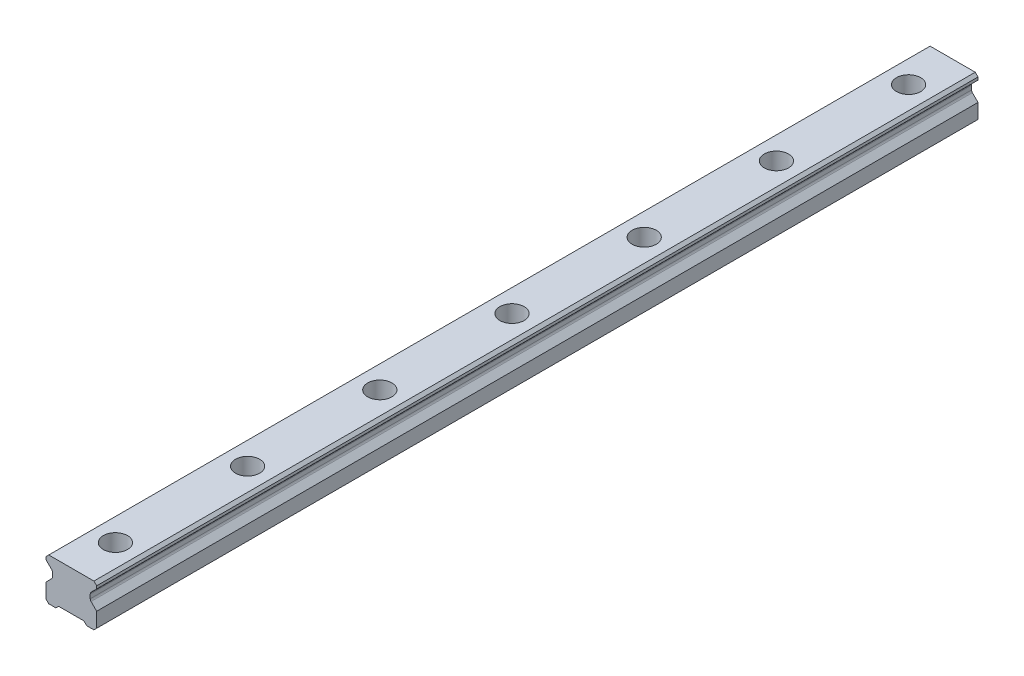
ISO-10303-21;
HEADER;
FILE_DESCRIPTION(('STEP AP214'),'2;1');
FILE_NAME('part.step','',(''),(''),'','','');
FILE_SCHEMA(('AUTOMOTIVE_DESIGN { 1 0 10303 214 1 1 1 1 }'));
ENDSEC;
DATA;
#1=APPLICATION_CONTEXT('core data for automotive mechanical design processes');
#2=APPLICATION_PROTOCOL_DEFINITION('international standard','automotive_design',2000,#1);
#3=PRODUCT_CONTEXT('',#1,'mechanical');
#4=PRODUCT('Part','Part','',(#3));
#5=PRODUCT_RELATED_PRODUCT_CATEGORY('part','',(#4));
#6=PRODUCT_DEFINITION_FORMATION('','',#4);
#7=PRODUCT_DEFINITION_CONTEXT('part definition',#1,'design');
#8=PRODUCT_DEFINITION('design','',#6,#7);
#9=PRODUCT_DEFINITION_SHAPE('','',#8);
#10=(LENGTH_UNIT() NAMED_UNIT(*) SI_UNIT(.MILLI.,.METRE.));
#11=(NAMED_UNIT(*) PLANE_ANGLE_UNIT() SI_UNIT($,.RADIAN.));
#12=(NAMED_UNIT(*) SI_UNIT($,.STERADIAN.) SOLID_ANGLE_UNIT());
#13=UNCERTAINTY_MEASURE_WITH_UNIT(LENGTH_MEASURE(1.E-05),#10,'distance_accuracy_value','');
#14=(GEOMETRIC_REPRESENTATION_CONTEXT(3) GLOBAL_UNCERTAINTY_ASSIGNED_CONTEXT((#13)) GLOBAL_UNIT_ASSIGNED_CONTEXT((#10,
#11,#12)) REPRESENTATION_CONTEXT('',''));
#15=CARTESIAN_POINT('',(0.,0.,0.));
#16=DIRECTION('',(0.,0.,1.));
#17=DIRECTION('',(1.,0.,0.));
#18=AXIS2_PLACEMENT_3D('',#15,#16,#17);
#19=CARTESIAN_POINT('',(0.,10.2,-180.));
#20=DIRECTION('',(0.,1.,0.));
#21=DIRECTION('',(0.,0.,1.));
#22=AXIS2_PLACEMENT_3D('',#19,#20,#21);
#23=PLANE('',#22);
#24=CARTESIAN_POINT('',(0.,10.2,-180.));
#25=DIRECTION('',(0.,1.,0.));
#26=DIRECTION('',(0.,0.,1.));
#27=AXIS2_PLACEMENT_3D('',#24,#25,#26);
#28=CIRCLE('',#27,3.5);
#29=CARTESIAN_POINT('',(0.,10.2,-176.5));
#30=VERTEX_POINT('',#29);
#31=EDGE_CURVE('E398',#30,#30,#28,.T.);
#32=ORIENTED_EDGE('',*,*,#31,.F.);
#33=EDGE_LOOP('',(#32));
#34=FACE_BOUND('',#33,.T.);
#35=CARTESIAN_POINT('',(0.,10.2,-180.));
#36=DIRECTION('',(0.,1.,0.));
#37=DIRECTION('',(0.,0.,1.));
#38=AXIS2_PLACEMENT_3D('',#35,#36,#37);
#39=CIRCLE('',#38,5.5);
#40=CARTESIAN_POINT('',(0.,10.2,-174.5));
#41=VERTEX_POINT('',#40);
#42=EDGE_CURVE('E11',#41,#41,#39,.T.);
#43=ORIENTED_EDGE('',*,*,#42,.T.);
#44=EDGE_LOOP('',(#43));
#45=FACE_BOUND('',#44,.T.);
#46=ADVANCED_FACE('F39',(#34,#45),#23,.T.);
#47=CARTESIAN_POINT('',(0.,10.2,-180.));
#48=DIRECTION('',(0.,1.,0.));
#49=DIRECTION('',(0.,0.,1.));
#50=AXIS2_PLACEMENT_3D('',#47,#48,#49);
#51=CYLINDRICAL_SURFACE('',#50,5.5);
#52=ORIENTED_EDGE('',*,*,#42,.F.);
#53=EDGE_LOOP('',(#52));
#54=FACE_BOUND('',#53,.T.);
#55=CARTESIAN_POINT('',(0.,19.2,-180.));
#56=DIRECTION('',(0.,1.,0.));
#57=DIRECTION('',(0.,0.,1.));
#58=AXIS2_PLACEMENT_3D('',#55,#56,#57);
#59=CIRCLE('',#58,5.5);
#60=CARTESIAN_POINT('',(0.,19.2,-174.5));
#61=VERTEX_POINT('',#60);
#62=EDGE_CURVE('E48',#61,#61,#59,.T.);
#63=ORIENTED_EDGE('',*,*,#62,.T.);
#64=EDGE_LOOP('',(#63));
#65=FACE_BOUND('',#64,.T.);
#66=ADVANCED_FACE('F635',(#54,#65),#51,.F.);
#67=CARTESIAN_POINT('',(0.,10.2,-120.));
#68=DIRECTION('',(0.,1.,0.));
#69=DIRECTION('',(0.,0.,1.));
#70=AXIS2_PLACEMENT_3D('',#67,#68,#69);
#71=PLANE('',#70);
#72=CARTESIAN_POINT('',(0.,10.2,-120.));
#73=DIRECTION('',(0.,1.,0.));
#74=DIRECTION('',(0.,0.,1.));
#75=AXIS2_PLACEMENT_3D('',#72,#73,#74);
#76=CIRCLE('',#75,3.5);
#77=CARTESIAN_POINT('',(0.,10.2,-116.5));
#78=VERTEX_POINT('',#77);
#79=EDGE_CURVE('E403',#78,#78,#76,.T.);
#80=ORIENTED_EDGE('',*,*,#79,.F.);
#81=EDGE_LOOP('',(#80));
#82=FACE_BOUND('',#81,.T.);
#83=CARTESIAN_POINT('',(0.,10.2,-120.));
#84=DIRECTION('',(0.,1.,0.));
#85=DIRECTION('',(0.,0.,1.));
#86=AXIS2_PLACEMENT_3D('',#83,#84,#85);
#87=CIRCLE('',#86,5.5);
#88=CARTESIAN_POINT('',(0.,10.2,-114.5));
#89=VERTEX_POINT('',#88);
#90=EDGE_CURVE('E382',#89,#89,#87,.T.);
#91=ORIENTED_EDGE('',*,*,#90,.T.);
#92=EDGE_LOOP('',(#91));
#93=FACE_BOUND('',#92,.T.);
#94=ADVANCED_FACE('F640',(#82,#93),#71,.T.);
#95=CARTESIAN_POINT('',(0.,10.2,-120.));
#96=DIRECTION('',(0.,1.,0.));
#97=DIRECTION('',(0.,0.,1.));
#98=AXIS2_PLACEMENT_3D('',#95,#96,#97);
#99=CYLINDRICAL_SURFACE('',#98,5.5);
#100=ORIENTED_EDGE('',*,*,#90,.F.);
#101=EDGE_LOOP('',(#100));
#102=FACE_BOUND('',#101,.T.);
#103=CARTESIAN_POINT('',(0.,19.2,-120.));
#104=DIRECTION('',(0.,1.,0.));
#105=DIRECTION('',(0.,0.,1.));
#106=AXIS2_PLACEMENT_3D('',#103,#104,#105);
#107=CIRCLE('',#106,5.5);
#108=CARTESIAN_POINT('',(0.,19.2,-114.5));
#109=VERTEX_POINT('',#108);
#110=EDGE_CURVE('E378',#109,#109,#107,.T.);
#111=ORIENTED_EDGE('',*,*,#110,.T.);
#112=EDGE_LOOP('',(#111));
#113=FACE_BOUND('',#112,.T.);
#114=ADVANCED_FACE('F715',(#102,#113),#99,.F.);
#115=CARTESIAN_POINT('',(0.,10.2,-60.));
#116=DIRECTION('',(0.,1.,0.));
#117=DIRECTION('',(0.,0.,1.));
#118=AXIS2_PLACEMENT_3D('',#115,#116,#117);
#119=PLANE('',#118);
#120=CARTESIAN_POINT('',(0.,10.2,-60.));
#121=DIRECTION('',(0.,1.,0.));
#122=DIRECTION('',(0.,0.,1.));
#123=AXIS2_PLACEMENT_3D('',#120,#121,#122);
#124=CIRCLE('',#123,3.5);
#125=CARTESIAN_POINT('',(0.,10.2,-56.5));
#126=VERTEX_POINT('',#125);
#127=EDGE_CURVE('E407',#126,#126,#124,.T.);
#128=ORIENTED_EDGE('',*,*,#127,.F.);
#129=EDGE_LOOP('',(#128));
#130=FACE_BOUND('',#129,.T.);
#131=CARTESIAN_POINT('',(0.,10.2,-60.));
#132=DIRECTION('',(0.,1.,0.));
#133=DIRECTION('',(0.,0.,1.));
#134=AXIS2_PLACEMENT_3D('',#131,#132,#133);
#135=CIRCLE('',#134,5.5);
#136=CARTESIAN_POINT('',(0.,10.2,-54.5));
#137=VERTEX_POINT('',#136);
#138=EDGE_CURVE('E374',#137,#137,#135,.T.);
#139=ORIENTED_EDGE('',*,*,#138,.T.);
#140=EDGE_LOOP('',(#139));
#141=FACE_BOUND('',#140,.T.);
#142=ADVANCED_FACE('F711',(#130,#141),#119,.T.);
#143=CARTESIAN_POINT('',(0.,10.2,-60.));
#144=DIRECTION('',(0.,1.,0.));
#145=DIRECTION('',(0.,0.,1.));
#146=AXIS2_PLACEMENT_3D('',#143,#144,#145);
#147=CYLINDRICAL_SURFACE('',#146,5.5);
#148=ORIENTED_EDGE('',*,*,#138,.F.);
#149=EDGE_LOOP('',(#148));
#150=FACE_BOUND('',#149,.T.);
#151=CARTESIAN_POINT('',(0.,19.2,-60.));
#152=DIRECTION('',(0.,1.,0.));
#153=DIRECTION('',(0.,0.,1.));
#154=AXIS2_PLACEMENT_3D('',#151,#152,#153);
#155=CIRCLE('',#154,5.5);
#156=CARTESIAN_POINT('',(0.,19.2,-54.5));
#157=VERTEX_POINT('',#156);
#158=EDGE_CURVE('E370',#157,#157,#155,.T.);
#159=ORIENTED_EDGE('',*,*,#158,.T.);
#160=EDGE_LOOP('',(#159));
#161=FACE_BOUND('',#160,.T.);
#162=ADVANCED_FACE('F707',(#150,#161),#147,.F.);
#163=CARTESIAN_POINT('',(0.,10.2,0.));
#164=DIRECTION('',(0.,1.,0.));
#165=DIRECTION('',(0.,0.,1.));
#166=AXIS2_PLACEMENT_3D('',#163,#164,#165);
#167=PLANE('',#166);
#168=CARTESIAN_POINT('',(0.,10.2,0.));
#169=DIRECTION('',(0.,1.,0.));
#170=DIRECTION('',(0.,0.,1.));
#171=AXIS2_PLACEMENT_3D('',#168,#169,#170);
#172=CIRCLE('',#171,3.5);
#173=CARTESIAN_POINT('',(0.,10.2,3.50000000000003));
#174=VERTEX_POINT('',#173);
#175=EDGE_CURVE('E411',#174,#174,#172,.T.);
#176=ORIENTED_EDGE('',*,*,#175,.F.);
#177=EDGE_LOOP('',(#176));
#178=FACE_BOUND('',#177,.T.);
#179=CARTESIAN_POINT('',(0.,10.2,0.));
#180=DIRECTION('',(0.,1.,0.));
#181=DIRECTION('',(0.,0.,1.));
#182=AXIS2_PLACEMENT_3D('',#179,#180,#181);
#183=CIRCLE('',#182,5.5);
#184=CARTESIAN_POINT('',(0.,10.2,5.50000000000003));
#185=VERTEX_POINT('',#184);
#186=EDGE_CURVE('E366',#185,#185,#183,.T.);
#187=ORIENTED_EDGE('',*,*,#186,.T.);
#188=EDGE_LOOP('',(#187));
#189=FACE_BOUND('',#188,.T.);
#190=ADVANCED_FACE('F703',(#178,#189),#167,.T.);
#191=CARTESIAN_POINT('',(0.,10.2,0.));
#192=DIRECTION('',(0.,1.,0.));
#193=DIRECTION('',(0.,0.,1.));
#194=AXIS2_PLACEMENT_3D('',#191,#192,#193);
#195=CYLINDRICAL_SURFACE('',#194,5.5);
#196=ORIENTED_EDGE('',*,*,#186,.F.);
#197=EDGE_LOOP('',(#196));
#198=FACE_BOUND('',#197,.T.);
#199=CARTESIAN_POINT('',(0.,19.2,0.));
#200=DIRECTION('',(0.,1.,0.));
#201=DIRECTION('',(0.,0.,1.));
#202=AXIS2_PLACEMENT_3D('',#199,#200,#201);
#203=CIRCLE('',#202,5.5);
#204=CARTESIAN_POINT('',(0.,19.2,5.50000000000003));
#205=VERTEX_POINT('',#204);
#206=EDGE_CURVE('E362',#205,#205,#203,.T.);
#207=ORIENTED_EDGE('',*,*,#206,.T.);
#208=EDGE_LOOP('',(#207));
#209=FACE_BOUND('',#208,.T.);
#210=ADVANCED_FACE('F699',(#198,#209),#195,.F.);
#211=CARTESIAN_POINT('',(0.,10.2,60.));
#212=DIRECTION('',(0.,1.,0.));
#213=DIRECTION('',(0.,0.,1.));
#214=AXIS2_PLACEMENT_3D('',#211,#212,#213);
#215=PLANE('',#214);
#216=CARTESIAN_POINT('',(0.,10.2,60.));
#217=DIRECTION('',(0.,1.,0.));
#218=DIRECTION('',(0.,0.,1.));
#219=AXIS2_PLACEMENT_3D('',#216,#217,#218);
#220=CIRCLE('',#219,3.5);
#221=CARTESIAN_POINT('',(0.,10.2,63.5));
#222=VERTEX_POINT('',#221);
#223=EDGE_CURVE('E426',#222,#222,#220,.T.);
#224=ORIENTED_EDGE('',*,*,#223,.F.);
#225=EDGE_LOOP('',(#224));
#226=FACE_BOUND('',#225,.T.);
#227=CARTESIAN_POINT('',(0.,10.2,60.));
#228=DIRECTION('',(0.,1.,0.));
#229=DIRECTION('',(0.,0.,1.));
#230=AXIS2_PLACEMENT_3D('',#227,#228,#229);
#231=CIRCLE('',#230,5.5);
#232=CARTESIAN_POINT('',(0.,10.2,65.5));
#233=VERTEX_POINT('',#232);
#234=EDGE_CURVE('E358',#233,#233,#231,.T.);
#235=ORIENTED_EDGE('',*,*,#234,.T.);
#236=EDGE_LOOP('',(#235));
#237=FACE_BOUND('',#236,.T.);
#238=ADVANCED_FACE('F695',(#226,#237),#215,.T.);
#239=CARTESIAN_POINT('',(0.,10.2,60.));
#240=DIRECTION('',(0.,1.,0.));
#241=DIRECTION('',(0.,0.,1.));
#242=AXIS2_PLACEMENT_3D('',#239,#240,#241);
#243=CYLINDRICAL_SURFACE('',#242,5.5);
#244=ORIENTED_EDGE('',*,*,#234,.F.);
#245=EDGE_LOOP('',(#244));
#246=FACE_BOUND('',#245,.T.);
#247=CARTESIAN_POINT('',(0.,19.2,60.));
#248=DIRECTION('',(0.,1.,0.));
#249=DIRECTION('',(0.,0.,1.));
#250=AXIS2_PLACEMENT_3D('',#247,#248,#249);
#251=CIRCLE('',#250,5.5);
#252=CARTESIAN_POINT('',(0.,19.2,65.5));
#253=VERTEX_POINT('',#252);
#254=EDGE_CURVE('E354',#253,#253,#251,.T.);
#255=ORIENTED_EDGE('',*,*,#254,.T.);
#256=EDGE_LOOP('',(#255));
#257=FACE_BOUND('',#256,.T.);
#258=ADVANCED_FACE('F692',(#246,#257),#243,.F.);
#259=CARTESIAN_POINT('',(11.5,0.,200.));
#260=DIRECTION('',(0.,1.,0.));
#261=DIRECTION('',(-1.,0.,0.));
#262=AXIS2_PLACEMENT_3D('',#259,#260,#261);
#263=PLANE('',#262);
#264=DIRECTION('',(1.,0.,0.));
#265=VECTOR('',#264,1.);
#266=CARTESIAN_POINT('',(11.5,0.,-200.));
#267=LINE('',#266,#265);
#268=CARTESIAN_POINT('',(-10.25,0.,-200.));
#269=VERTEX_POINT('',#268);
#270=CARTESIAN_POINT('',(-7.,0.,-200.));
#271=VERTEX_POINT('',#270);
#272=EDGE_CURVE('E229',#269,#271,#267,.T.);
#273=ORIENTED_EDGE('',*,*,#272,.T.);
#274=DIRECTION('',(0.,0.,1.));
#275=VECTOR('',#274,1.);
#276=CARTESIAN_POINT('',(-7.,0.,-200.));
#277=LINE('',#276,#275);
#278=CARTESIAN_POINT('',(-7.,0.,200.));
#279=VERTEX_POINT('',#278);
#280=EDGE_CURVE('E466',#271,#279,#277,.T.);
#281=ORIENTED_EDGE('',*,*,#280,.T.);
#282=DIRECTION('',(1.,0.,0.));
#283=VECTOR('',#282,1.);
#284=CARTESIAN_POINT('',(11.5,0.,200.));
#285=LINE('',#284,#283);
#286=CARTESIAN_POINT('',(-10.25,0.,200.));
#287=VERTEX_POINT('',#286);
#288=EDGE_CURVE('E535',#287,#279,#285,.T.);
#289=ORIENTED_EDGE('',*,*,#288,.F.);
#290=DIRECTION('',(0.,0.,-1.));
#291=VECTOR('',#290,1.);
#292=CARTESIAN_POINT('',(-10.25,0.,200.));
#293=LINE('',#292,#291);
#294=EDGE_CURVE('E289',#287,#269,#293,.T.);
#295=ORIENTED_EDGE('',*,*,#294,.T.);
#296=EDGE_LOOP('',(#273,#281,#289,#295));
#297=FACE_BOUND('',#296,.T.);
#298=ADVANCED_FACE('F664',(#297),#263,.F.);
#299=CARTESIAN_POINT('',(-11.5,19.2,200.));
#300=DIRECTION('',(1.,0.,0.));
#301=DIRECTION('',(0.,1.,0.));
#302=AXIS2_PLACEMENT_3D('',#299,#300,#301);
#303=PLANE('',#302);
#304=DIRECTION('',(0.,-1.,0.));
#305=VECTOR('',#304,1.);
#306=CARTESIAN_POINT('',(-11.5,19.2,200.));
#307=LINE('',#306,#305);
#308=CARTESIAN_POINT('',(-11.5,17.95,200.));
#309=VERTEX_POINT('',#308);
#310=CARTESIAN_POINT('',(-11.5,16.7,200.));
#311=VERTEX_POINT('',#310);
#312=EDGE_CURVE('E531',#309,#311,#307,.T.);
#313=ORIENTED_EDGE('',*,*,#312,.F.);
#314=DIRECTION('',(0.,0.,-1.));
#315=VECTOR('',#314,1.);
#316=CARTESIAN_POINT('',(-11.5,17.95,200.));
#317=LINE('',#316,#315);
#318=CARTESIAN_POINT('',(-11.5,17.95,-200.));
#319=VERTEX_POINT('',#318);
#320=EDGE_CURVE('E251',#309,#319,#317,.T.);
#321=ORIENTED_EDGE('',*,*,#320,.T.);
#322=DIRECTION('',(0.,-1.,0.));
#323=VECTOR('',#322,1.);
#324=CARTESIAN_POINT('',(-11.5,19.2,-200.));
#325=LINE('',#324,#323);
#326=CARTESIAN_POINT('',(-11.5,16.7,-200.));
#327=VERTEX_POINT('',#326);
#328=EDGE_CURVE('E230',#319,#327,#325,.T.);
#329=ORIENTED_EDGE('',*,*,#328,.T.);
#330=DIRECTION('',(0.,0.,1.));
#331=VECTOR('',#330,1.);
#332=CARTESIAN_POINT('',(-11.5,16.7,-200.));
#333=LINE('',#332,#331);
#334=EDGE_CURVE('E487',#327,#311,#333,.T.);
#335=ORIENTED_EDGE('',*,*,#334,.T.);
#336=EDGE_LOOP('',(#313,#321,#329,#335));
#337=FACE_BOUND('',#336,.T.);
#338=ADVANCED_FACE('F560',(#337),#303,.F.);
#339=CARTESIAN_POINT('',(11.5,19.2,200.));
#340=DIRECTION('',(-1.,0.,0.));
#341=DIRECTION('',(0.,0.,1.));
#342=AXIS2_PLACEMENT_3D('',#339,#340,#341);
#343=PLANE('',#342);
#344=DIRECTION('',(0.,1.,0.));
#345=VECTOR('',#344,1.);
#346=CARTESIAN_POINT('',(11.5,19.2,200.));
#347=LINE('',#346,#345);
#348=CARTESIAN_POINT('',(11.5,1.25000000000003,200.));
#349=VERTEX_POINT('',#348);
#350=CARTESIAN_POINT('',(11.5,7.95,200.));
#351=VERTEX_POINT('',#350);
#352=EDGE_CURVE('E540',#349,#351,#347,.T.);
#353=ORIENTED_EDGE('',*,*,#352,.F.);
#354=DIRECTION('',(0.,0.,-1.));
#355=VECTOR('',#354,1.);
#356=CARTESIAN_POINT('',(11.5,1.25000000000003,200.));
#357=LINE('',#356,#355);
#358=CARTESIAN_POINT('',(11.5,1.25000000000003,-200.));
#359=VERTEX_POINT('',#358);
#360=EDGE_CURVE('E296',#349,#359,#357,.T.);
#361=ORIENTED_EDGE('',*,*,#360,.T.);
#362=DIRECTION('',(0.,1.,0.));
#363=VECTOR('',#362,1.);
#364=CARTESIAN_POINT('',(11.5,19.2,-200.));
#365=LINE('',#364,#363);
#366=CARTESIAN_POINT('',(11.5,7.95,-200.));
#367=VERTEX_POINT('',#366);
#368=EDGE_CURVE('E243',#359,#367,#365,.T.);
#369=ORIENTED_EDGE('',*,*,#368,.T.);
#370=DIRECTION('',(0.,0.,1.));
#371=VECTOR('',#370,1.);
#372=CARTESIAN_POINT('',(11.5,7.95,-200.));
#373=LINE('',#372,#371);
#374=EDGE_CURVE('E516',#367,#351,#373,.T.);
#375=ORIENTED_EDGE('',*,*,#374,.T.);
#376=EDGE_LOOP('',(#353,#361,#369,#375));
#377=FACE_BOUND('',#376,.T.);
#378=ADVANCED_FACE('F657',(#377),#343,.F.);
#379=CARTESIAN_POINT('',(-11.5,7.95,-200.));
#380=VERTEX_POINT('',#379);
#381=CARTESIAN_POINT('',(-11.5,1.24999999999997,-200.));
#382=VERTEX_POINT('',#381);
#383=EDGE_CURVE('E239',#380,#382,#325,.T.);
#384=ORIENTED_EDGE('',*,*,#383,.T.);
#385=DIRECTION('',(0.,0.,1.));
#386=VECTOR('',#385,1.);
#387=CARTESIAN_POINT('',(-11.5,1.24999999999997,200.));
#388=LINE('',#387,#386);
#389=CARTESIAN_POINT('',(-11.5,1.24999999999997,200.));
#390=VERTEX_POINT('',#389);
#391=EDGE_CURVE('E293',#382,#390,#388,.T.);
#392=ORIENTED_EDGE('',*,*,#391,.T.);
#393=CARTESIAN_POINT('',(-11.5,7.95,200.));
#394=VERTEX_POINT('',#393);
#395=EDGE_CURVE('E250',#394,#390,#307,.T.);
#396=ORIENTED_EDGE('',*,*,#395,.F.);
#397=DIRECTION('',(0.,0.,1.));
#398=VECTOR('',#397,1.);
#399=CARTESIAN_POINT('',(-11.5,7.95,-200.));
#400=LINE('',#399,#398);
#401=EDGE_CURVE('E498',#380,#394,#400,.T.);
#402=ORIENTED_EDGE('',*,*,#401,.F.);
#403=EDGE_LOOP('',(#384,#392,#396,#402));
#404=FACE_BOUND('',#403,.T.);
#405=ADVANCED_FACE('F588',(#404),#303,.F.);
#406=CARTESIAN_POINT('',(7.,0.,200.));
#407=VERTEX_POINT('',#406);
#408=CARTESIAN_POINT('',(10.25,0.,200.));
#409=VERTEX_POINT('',#408);
#410=EDGE_CURVE('E219',#407,#409,#285,.T.);
#411=ORIENTED_EDGE('',*,*,#410,.F.);
#412=DIRECTION('',(0.,0.,1.));
#413=VECTOR('',#412,1.);
#414=CARTESIAN_POINT('',(7.,0.,-200.));
#415=LINE('',#414,#413);
#416=CARTESIAN_POINT('',(7.,0.,-200.));
#417=VERTEX_POINT('',#416);
#418=EDGE_CURVE('E206',#417,#407,#415,.T.);
#419=ORIENTED_EDGE('',*,*,#418,.F.);
#420=CARTESIAN_POINT('',(10.25,0.,-200.));
#421=VERTEX_POINT('',#420);
#422=EDGE_CURVE('E217',#417,#421,#267,.T.);
#423=ORIENTED_EDGE('',*,*,#422,.T.);
#424=DIRECTION('',(0.,0.,1.));
#425=VECTOR('',#424,1.);
#426=CARTESIAN_POINT('',(10.25,0.,200.));
#427=LINE('',#426,#425);
#428=EDGE_CURVE('E286',#421,#409,#427,.T.);
#429=ORIENTED_EDGE('',*,*,#428,.T.);
#430=EDGE_LOOP('',(#411,#419,#423,#429));
#431=FACE_BOUND('',#430,.T.);
#432=ADVANCED_FACE('F215',(#431),#263,.F.);
#433=CARTESIAN_POINT('',(11.5,16.7,-200.));
#434=VERTEX_POINT('',#433);
#435=CARTESIAN_POINT('',(11.5,17.95,-200.));
#436=VERTEX_POINT('',#435);
#437=EDGE_CURVE('E236',#434,#436,#365,.T.);
#438=ORIENTED_EDGE('',*,*,#437,.T.);
#439=DIRECTION('',(0.,0.,1.));
#440=VECTOR('',#439,1.);
#441=CARTESIAN_POINT('',(11.5,17.95,200.));
#442=LINE('',#441,#440);
#443=CARTESIAN_POINT('',(11.5,17.95,200.));
#444=VERTEX_POINT('',#443);
#445=EDGE_CURVE('E300',#436,#444,#442,.T.);
#446=ORIENTED_EDGE('',*,*,#445,.T.);
#447=CARTESIAN_POINT('',(11.5,16.7,200.));
#448=VERTEX_POINT('',#447);
#449=EDGE_CURVE('E539',#448,#444,#347,.T.);
#450=ORIENTED_EDGE('',*,*,#449,.F.);
#451=DIRECTION('',(0.,0.,1.));
#452=VECTOR('',#451,1.);
#453=CARTESIAN_POINT('',(11.5,16.7,-200.));
#454=LINE('',#453,#452);
#455=EDGE_CURVE('E491',#434,#448,#454,.T.);
#456=ORIENTED_EDGE('',*,*,#455,.F.);
#457=EDGE_LOOP('',(#438,#446,#450,#456));
#458=FACE_BOUND('',#457,.T.);
#459=ADVANCED_FACE('F607',(#458),#343,.F.);
#460=CARTESIAN_POINT('',(11.5,19.2,200.));
#461=DIRECTION('',(0.,-1.,0.));
#462=DIRECTION('',(0.,0.,-1.));
#463=AXIS2_PLACEMENT_3D('',#460,#461,#462);
#464=PLANE('',#463);
#465=CARTESIAN_POINT('',(0.,19.2,120.));
#466=DIRECTION('',(0.,1.,0.));
#467=DIRECTION('',(0.,0.,1.));
#468=AXIS2_PLACEMENT_3D('',#465,#466,#467);
#469=CIRCLE('',#468,5.5);
#470=CARTESIAN_POINT('',(0.,19.2,125.5));
#471=VERTEX_POINT('',#470);
#472=EDGE_CURVE('E430',#471,#471,#469,.T.);
#473=ORIENTED_EDGE('',*,*,#472,.F.);
#474=EDGE_LOOP('',(#473));
#475=FACE_BOUND('',#474,.T.);
#476=CARTESIAN_POINT('',(0.,19.2,180.));
#477=DIRECTION('',(0.,1.,0.));
#478=DIRECTION('',(0.,0.,1.));
#479=AXIS2_PLACEMENT_3D('',#476,#477,#478);
#480=CIRCLE('',#479,5.5);
#481=CARTESIAN_POINT('',(0.,19.2,185.5));
#482=VERTEX_POINT('',#481);
#483=EDGE_CURVE('E446',#482,#482,#480,.T.);
#484=ORIENTED_EDGE('',*,*,#483,.F.);
#485=EDGE_LOOP('',(#484));
#486=FACE_BOUND('',#485,.T.);
#487=DIRECTION('',(-1.,0.,0.));
#488=VECTOR('',#487,1.);
#489=CARTESIAN_POINT('',(11.5,19.2,-200.));
#490=LINE('',#489,#488);
#491=CARTESIAN_POINT('',(10.25,19.2,-200.));
#492=VERTEX_POINT('',#491);
#493=CARTESIAN_POINT('',(-10.25,19.2,-200.));
#494=VERTEX_POINT('',#493);
#495=EDGE_CURVE('E246',#492,#494,#490,.T.);
#496=ORIENTED_EDGE('',*,*,#495,.T.);
#497=DIRECTION('',(0.,0.,1.));
#498=VECTOR('',#497,1.);
#499=CARTESIAN_POINT('',(-10.25,19.2,200.));
#500=LINE('',#499,#498);
#501=CARTESIAN_POINT('',(-10.25,19.2,200.));
#502=VERTEX_POINT('',#501);
#503=EDGE_CURVE('E271',#494,#502,#500,.T.);
#504=ORIENTED_EDGE('',*,*,#503,.T.);
#505=DIRECTION('',(-1.,0.,0.));
#506=VECTOR('',#505,1.);
#507=CARTESIAN_POINT('',(11.5,19.2,200.));
#508=LINE('',#507,#506);
#509=CARTESIAN_POINT('',(10.25,19.2,200.));
#510=VERTEX_POINT('',#509);
#511=EDGE_CURVE('E256',#510,#502,#508,.T.);
#512=ORIENTED_EDGE('',*,*,#511,.F.);
#513=DIRECTION('',(0.,0.,-1.));
#514=VECTOR('',#513,1.);
#515=CARTESIAN_POINT('',(10.25,19.2,200.));
#516=LINE('',#515,#514);
#517=EDGE_CURVE('E267',#510,#492,#516,.T.);
#518=ORIENTED_EDGE('',*,*,#517,.T.);
#519=EDGE_LOOP('',(#496,#504,#512,#518));
#520=FACE_BOUND('',#519,.T.);
#521=ORIENTED_EDGE('',*,*,#254,.F.);
#522=EDGE_LOOP('',(#521));
#523=FACE_BOUND('',#522,.T.);
#524=ORIENTED_EDGE('',*,*,#206,.F.);
#525=EDGE_LOOP('',(#524));
#526=FACE_BOUND('',#525,.T.);
#527=ORIENTED_EDGE('',*,*,#158,.F.);
#528=EDGE_LOOP('',(#527));
#529=FACE_BOUND('',#528,.T.);
#530=ORIENTED_EDGE('',*,*,#110,.F.);
#531=EDGE_LOOP('',(#530));
#532=FACE_BOUND('',#531,.T.);
#533=ORIENTED_EDGE('',*,*,#62,.F.);
#534=EDGE_LOOP('',(#533));
#535=FACE_BOUND('',#534,.T.);
#536=ADVANCED_FACE('F603',(#475,#486,#520,#523,#526,#529,#532,#535),#464,.F.);
#537=CARTESIAN_POINT('',(0.,0.,200.));
#538=DIRECTION('',(0.,0.,-1.));
#539=DIRECTION('',(-1.,0.,0.));
#540=AXIS2_PLACEMENT_3D('',#537,#538,#539);
#541=PLANE('',#540);
#542=ORIENTED_EDGE('',*,*,#288,.T.);
#543=DIRECTION('',(-0.707106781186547,-0.707106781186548,0.));
#544=VECTOR('',#543,1.);
#545=CARTESIAN_POINT('',(-7.,0.,200.));
#546=LINE('',#545,#544);
#547=CARTESIAN_POINT('',(-5.75,1.25,200.));
#548=VERTEX_POINT('',#547);
#549=EDGE_CURVE('E211',#548,#279,#546,.T.);
#550=ORIENTED_EDGE('',*,*,#549,.F.);
#551=DIRECTION('',(-1.,0.,0.));
#552=VECTOR('',#551,1.);
#553=CARTESIAN_POINT('',(-5.75,1.25,200.));
#554=LINE('',#553,#552);
#555=CARTESIAN_POINT('',(5.75,1.25,200.));
#556=VERTEX_POINT('',#555);
#557=EDGE_CURVE('E460',#556,#548,#554,.T.);
#558=ORIENTED_EDGE('',*,*,#557,.F.);
#559=DIRECTION('',(-0.707106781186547,0.707106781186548,0.));
#560=VECTOR('',#559,1.);
#561=CARTESIAN_POINT('',(5.75,1.25,200.));
#562=LINE('',#561,#560);
#563=EDGE_CURVE('E451',#407,#556,#562,.T.);
#564=ORIENTED_EDGE('',*,*,#563,.F.);
#565=ORIENTED_EDGE('',*,*,#410,.T.);
#566=DIRECTION('',(-0.707106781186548,-0.707106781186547,0.));
#567=VECTOR('',#566,1.);
#568=CARTESIAN_POINT('',(11.5,1.25000000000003,200.));
#569=LINE('',#568,#567);
#570=EDGE_CURVE('E277',#409,#349,#569,.F.);
#571=ORIENTED_EDGE('',*,*,#570,.T.);
#572=ORIENTED_EDGE('',*,*,#352,.T.);
#573=DIRECTION('',(0.707106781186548,-0.707106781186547,0.));
#574=VECTOR('',#573,1.);
#575=CARTESIAN_POINT('',(11.5,7.95,200.));
#576=LINE('',#575,#574);
#577=CARTESIAN_POINT('',(8.94944985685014,10.5005501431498,200.));
#578=VERTEX_POINT('',#577);
#579=EDGE_CURVE('E470',#578,#351,#576,.T.);
#580=ORIENTED_EDGE('',*,*,#579,.F.);
#581=CARTESIAN_POINT('',(9.83333333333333,11.384433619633,200.));
#582=DIRECTION('',(0.,0.,-1.));
#583=DIRECTION('',(-1.,0.,0.));
#584=AXIS2_PLACEMENT_3D('',#581,#582,#583);
#585=CIRCLE('',#584,1.25);
#586=CARTESIAN_POINT('',(8.58333333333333,11.384433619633,200.));
#587=VERTEX_POINT('',#586);
#588=EDGE_CURVE('E331',#578,#587,#585,.T.);
#589=ORIENTED_EDGE('',*,*,#588,.T.);
#590=DIRECTION('',(0.,-1.,0.));
#591=VECTOR('',#590,1.);
#592=CARTESIAN_POINT('',(8.58333333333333,10.8666666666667,200.));
#593=LINE('',#592,#591);
#594=CARTESIAN_POINT('',(8.58333333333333,13.265566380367,200.));
#595=VERTEX_POINT('',#594);
#596=EDGE_CURVE('E508',#595,#587,#593,.T.);
#597=ORIENTED_EDGE('',*,*,#596,.F.);
#598=CARTESIAN_POINT('',(9.83333333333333,13.265566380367,200.));
#599=DIRECTION('',(0.,0.,-1.));
#600=DIRECTION('',(-1.,0.,0.));
#601=AXIS2_PLACEMENT_3D('',#598,#599,#600);
#602=CIRCLE('',#601,1.25);
#603=CARTESIAN_POINT('',(8.94944985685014,14.1494498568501,200.));
#604=VERTEX_POINT('',#603);
#605=EDGE_CURVE('E337',#595,#604,#602,.T.);
#606=ORIENTED_EDGE('',*,*,#605,.T.);
#607=DIRECTION('',(-0.707106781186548,-0.707106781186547,0.));
#608=VECTOR('',#607,1.);
#609=CARTESIAN_POINT('',(8.58333333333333,13.7833333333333,200.));
#610=LINE('',#609,#608);
#611=EDGE_CURVE('E519',#448,#604,#610,.T.);
#612=ORIENTED_EDGE('',*,*,#611,.F.);
#613=ORIENTED_EDGE('',*,*,#449,.T.);
#614=DIRECTION('',(0.707106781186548,-0.707106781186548,0.));
#615=VECTOR('',#614,1.);
#616=CARTESIAN_POINT('',(10.25,19.2,200.));
#617=LINE('',#616,#615);
#618=EDGE_CURVE('E274',#444,#510,#617,.F.);
#619=ORIENTED_EDGE('',*,*,#618,.T.);
#620=ORIENTED_EDGE('',*,*,#511,.T.);
#621=DIRECTION('',(0.707106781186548,0.707106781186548,0.));
#622=VECTOR('',#621,1.);
#623=CARTESIAN_POINT('',(-11.5,17.95,200.));
#624=LINE('',#623,#622);
#625=EDGE_CURVE('E283',#502,#309,#624,.F.);
#626=ORIENTED_EDGE('',*,*,#625,.T.);
#627=ORIENTED_EDGE('',*,*,#312,.T.);
#628=DIRECTION('',(-0.707106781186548,0.707106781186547,0.));
#629=VECTOR('',#628,1.);
#630=CARTESIAN_POINT('',(-8.58333333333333,13.7833333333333,200.));
#631=LINE('',#630,#629);
#632=CARTESIAN_POINT('',(-8.94944985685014,14.1494498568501,200.));
#633=VERTEX_POINT('',#632);
#634=EDGE_CURVE('E488',#633,#311,#631,.T.);
#635=ORIENTED_EDGE('',*,*,#634,.F.);
#636=CARTESIAN_POINT('',(-9.83333333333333,13.265566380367,200.));
#637=DIRECTION('',(0.,0.,-1.));
#638=DIRECTION('',(-1.,0.,0.));
#639=AXIS2_PLACEMENT_3D('',#636,#637,#638);
#640=CIRCLE('',#639,1.25);
#641=CARTESIAN_POINT('',(-8.58333333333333,13.265566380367,200.));
#642=VERTEX_POINT('',#641);
#643=EDGE_CURVE('E349',#633,#642,#640,.T.);
#644=ORIENTED_EDGE('',*,*,#643,.T.);
#645=DIRECTION('',(0.,1.,0.));
#646=VECTOR('',#645,1.);
#647=CARTESIAN_POINT('',(-8.58333333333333,10.8666666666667,200.));
#648=LINE('',#647,#646);
#649=CARTESIAN_POINT('',(-8.58333333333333,11.384433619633,200.));
#650=VERTEX_POINT('',#649);
#651=EDGE_CURVE('E480',#650,#642,#648,.T.);
#652=ORIENTED_EDGE('',*,*,#651,.F.);
#653=CARTESIAN_POINT('',(-9.83333333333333,11.384433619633,200.));
#654=DIRECTION('',(0.,0.,-1.));
#655=DIRECTION('',(-1.,0.,0.));
#656=AXIS2_PLACEMENT_3D('',#653,#654,#655);
#657=CIRCLE('',#656,1.25);
#658=CARTESIAN_POINT('',(-8.94944985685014,10.5005501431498,200.));
#659=VERTEX_POINT('',#658);
#660=EDGE_CURVE('E343',#650,#659,#657,.T.);
#661=ORIENTED_EDGE('',*,*,#660,.T.);
#662=DIRECTION('',(0.707106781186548,0.707106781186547,0.));
#663=VECTOR('',#662,1.);
#664=CARTESIAN_POINT('',(-11.5,7.95,200.));
#665=LINE('',#664,#663);
#666=EDGE_CURVE('E490',#394,#659,#665,.T.);
#667=ORIENTED_EDGE('',*,*,#666,.F.);
#668=ORIENTED_EDGE('',*,*,#395,.T.);
#669=DIRECTION('',(-0.707106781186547,0.707106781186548,0.));
#670=VECTOR('',#669,1.);
#671=CARTESIAN_POINT('',(-10.25,0.,200.));
#672=LINE('',#671,#670);
#673=EDGE_CURVE('E280',#390,#287,#672,.F.);
#674=ORIENTED_EDGE('',*,*,#673,.T.);
#675=EDGE_LOOP('',(#542,#550,#558,#564,#565,#571,#572,#580,#589,#597,#606,#612,#613,#619,#620,
#626,#627,#635,#644,#652,#661,#667,#668,#674));
#676=FACE_BOUND('',#675,.T.);
#677=ADVANCED_FACE('F548',(#676),#541,.F.);
#678=CARTESIAN_POINT('',(0.,0.,-200.));
#679=DIRECTION('',(0.,0.,-1.));
#680=DIRECTION('',(-1.,0.,0.));
#681=AXIS2_PLACEMENT_3D('',#678,#679,#680);
#682=PLANE('',#681);
#683=DIRECTION('',(-0.707106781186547,-0.707106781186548,0.));
#684=VECTOR('',#683,1.);
#685=CARTESIAN_POINT('',(-7.,0.,-200.));
#686=LINE('',#685,#684);
#687=CARTESIAN_POINT('',(-5.75,1.25,-200.));
#688=VERTEX_POINT('',#687);
#689=EDGE_CURVE('E221',#688,#271,#686,.T.);
#690=ORIENTED_EDGE('',*,*,#689,.T.);
#691=ORIENTED_EDGE('',*,*,#272,.F.);
#692=DIRECTION('',(0.707106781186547,-0.707106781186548,0.));
#693=VECTOR('',#692,1.);
#694=CARTESIAN_POINT('',(-5.12500000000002,-5.12500000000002,-200.));
#695=LINE('',#694,#693);
#696=EDGE_CURVE('E261',#269,#382,#695,.F.);
#697=ORIENTED_EDGE('',*,*,#696,.T.);
#698=ORIENTED_EDGE('',*,*,#383,.F.);
#699=DIRECTION('',(0.707106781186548,0.707106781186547,0.));
#700=VECTOR('',#699,1.);
#701=CARTESIAN_POINT('',(-11.5,7.95,-200.));
#702=LINE('',#701,#700);
#703=CARTESIAN_POINT('',(-8.94944985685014,10.5005501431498,-200.));
#704=VERTEX_POINT('',#703);
#705=EDGE_CURVE('E479',#380,#704,#702,.T.);
#706=ORIENTED_EDGE('',*,*,#705,.T.);
#707=CARTESIAN_POINT('',(-9.83333333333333,11.384433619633,-200.));
#708=DIRECTION('',(0.,0.,-1.));
#709=DIRECTION('',(-1.,0.,0.));
#710=AXIS2_PLACEMENT_3D('',#707,#708,#709);
#711=CIRCLE('',#710,1.25);
#712=CARTESIAN_POINT('',(-8.58333333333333,11.384433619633,-200.));
#713=VERTEX_POINT('',#712);
#714=EDGE_CURVE('E346',#704,#713,#711,.F.);
#715=ORIENTED_EDGE('',*,*,#714,.T.);
#716=DIRECTION('',(0.,1.,0.));
#717=VECTOR('',#716,1.);
#718=CARTESIAN_POINT('',(-8.58333333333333,10.8666666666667,-200.));
#719=LINE('',#718,#717);
#720=CARTESIAN_POINT('',(-8.58333333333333,13.265566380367,-200.));
#721=VERTEX_POINT('',#720);
#722=EDGE_CURVE('E484',#713,#721,#719,.T.);
#723=ORIENTED_EDGE('',*,*,#722,.T.);
#724=CARTESIAN_POINT('',(-9.83333333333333,13.265566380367,-200.));
#725=DIRECTION('',(0.,0.,-1.));
#726=DIRECTION('',(-1.,0.,0.));
#727=AXIS2_PLACEMENT_3D('',#724,#725,#726);
#728=CIRCLE('',#727,1.25);
#729=CARTESIAN_POINT('',(-8.94944985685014,14.1494498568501,-200.));
#730=VERTEX_POINT('',#729);
#731=EDGE_CURVE('E64',#721,#730,#728,.F.);
#732=ORIENTED_EDGE('',*,*,#731,.T.);
#733=DIRECTION('',(-0.707106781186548,0.707106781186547,0.));
#734=VECTOR('',#733,1.);
#735=CARTESIAN_POINT('',(-8.58333333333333,13.7833333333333,-200.));
#736=LINE('',#735,#734);
#737=EDGE_CURVE('E476',#730,#327,#736,.T.);
#738=ORIENTED_EDGE('',*,*,#737,.T.);
#739=ORIENTED_EDGE('',*,*,#328,.F.);
#740=DIRECTION('',(-0.707106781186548,-0.707106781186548,0.));
#741=VECTOR('',#740,1.);
#742=CARTESIAN_POINT('',(-14.725,14.725,-200.));
#743=LINE('',#742,#741);
#744=EDGE_CURVE('E264',#319,#494,#743,.F.);
#745=ORIENTED_EDGE('',*,*,#744,.T.);
#746=ORIENTED_EDGE('',*,*,#495,.F.);
#747=DIRECTION('',(-0.707106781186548,0.707106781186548,0.));
#748=VECTOR('',#747,1.);
#749=CARTESIAN_POINT('',(14.725,14.725,-200.));
#750=LINE('',#749,#748);
#751=EDGE_CURVE('E255',#492,#436,#750,.F.);
#752=ORIENTED_EDGE('',*,*,#751,.T.);
#753=ORIENTED_EDGE('',*,*,#437,.F.);
#754=DIRECTION('',(-0.707106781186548,-0.707106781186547,0.));
#755=VECTOR('',#754,1.);
#756=CARTESIAN_POINT('',(8.58333333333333,13.7833333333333,-200.));
#757=LINE('',#756,#755);
#758=CARTESIAN_POINT('',(8.94944985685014,14.1494498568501,-200.));
#759=VERTEX_POINT('',#758);
#760=EDGE_CURVE('E507',#434,#759,#757,.T.);
#761=ORIENTED_EDGE('',*,*,#760,.T.);
#762=CARTESIAN_POINT('',(9.83333333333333,13.265566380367,-200.));
#763=DIRECTION('',(0.,0.,-1.));
#764=DIRECTION('',(-1.,0.,0.));
#765=AXIS2_PLACEMENT_3D('',#762,#763,#764);
#766=CIRCLE('',#765,1.25);
#767=CARTESIAN_POINT('',(8.58333333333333,13.265566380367,-200.));
#768=VERTEX_POINT('',#767);
#769=EDGE_CURVE('E340',#759,#768,#766,.F.);
#770=ORIENTED_EDGE('',*,*,#769,.T.);
#771=DIRECTION('',(0.,-1.,0.));
#772=VECTOR('',#771,1.);
#773=CARTESIAN_POINT('',(8.58333333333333,10.8666666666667,-200.));
#774=LINE('',#773,#772);
#775=CARTESIAN_POINT('',(8.58333333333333,11.384433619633,-200.));
#776=VERTEX_POINT('',#775);
#777=EDGE_CURVE('E512',#768,#776,#774,.T.);
#778=ORIENTED_EDGE('',*,*,#777,.T.);
#779=CARTESIAN_POINT('',(9.83333333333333,11.384433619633,-200.));
#780=DIRECTION('',(0.,0.,-1.));
#781=DIRECTION('',(-1.,0.,0.));
#782=AXIS2_PLACEMENT_3D('',#779,#780,#781);
#783=CIRCLE('',#782,1.25);
#784=CARTESIAN_POINT('',(8.94944985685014,10.5005501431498,-200.));
#785=VERTEX_POINT('',#784);
#786=EDGE_CURVE('E334',#776,#785,#783,.F.);
#787=ORIENTED_EDGE('',*,*,#786,.T.);
#788=DIRECTION('',(0.707106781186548,-0.707106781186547,0.));
#789=VECTOR('',#788,1.);
#790=CARTESIAN_POINT('',(11.5,7.95,-200.));
#791=LINE('',#790,#789);
#792=EDGE_CURVE('E504',#785,#367,#791,.T.);
#793=ORIENTED_EDGE('',*,*,#792,.T.);
#794=ORIENTED_EDGE('',*,*,#368,.F.);
#795=DIRECTION('',(0.707106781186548,0.707106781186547,0.));
#796=VECTOR('',#795,1.);
#797=CARTESIAN_POINT('',(5.12499999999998,-5.12499999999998,-200.));
#798=LINE('',#797,#796);
#799=EDGE_CURVE('E226',#359,#421,#798,.F.);
#800=ORIENTED_EDGE('',*,*,#799,.T.);
#801=ORIENTED_EDGE('',*,*,#422,.F.);
#802=DIRECTION('',(-0.707106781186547,0.707106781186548,0.));
#803=VECTOR('',#802,1.);
#804=CARTESIAN_POINT('',(5.75,1.25,-200.));
#805=LINE('',#804,#803);
#806=CARTESIAN_POINT('',(5.75,1.25,-200.));
#807=VERTEX_POINT('',#806);
#808=EDGE_CURVE('E202',#417,#807,#805,.T.);
#809=ORIENTED_EDGE('',*,*,#808,.T.);
#810=DIRECTION('',(-1.,0.,0.));
#811=VECTOR('',#810,1.);
#812=CARTESIAN_POINT('',(-5.75,1.25,-200.));
#813=LINE('',#812,#811);
#814=EDGE_CURVE('E56',#807,#688,#813,.T.);
#815=ORIENTED_EDGE('',*,*,#814,.T.);
#816=EDGE_LOOP('',(#690,#691,#697,#698,#706,#715,#723,#732,#738,#739,#745,#746,#752,#753,#761,
#770,#778,#787,#793,#794,#800,#801,#809,#815));
#817=FACE_BOUND('',#816,.T.);
#818=ADVANCED_FACE('F224',(#817),#682,.T.);
#819=CARTESIAN_POINT('',(11.5,7.95,-200.));
#820=DIRECTION('',(-0.707106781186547,-0.707106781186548,0.));
#821=DIRECTION('',(0.707106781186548,-0.707106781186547,0.));
#822=AXIS2_PLACEMENT_3D('',#819,#820,#821);
#823=PLANE('',#822);
#824=ORIENTED_EDGE('',*,*,#792,.F.);
#825=DIRECTION('',(0.,0.,1.));
#826=VECTOR('',#825,1.);
#827=CARTESIAN_POINT('',(8.94944985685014,10.5005501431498,200.));
#828=LINE('',#827,#826);
#829=EDGE_CURVE('E303',#785,#578,#828,.T.);
#830=ORIENTED_EDGE('',*,*,#829,.T.);
#831=ORIENTED_EDGE('',*,*,#579,.T.);
#832=ORIENTED_EDGE('',*,*,#374,.F.);
#833=EDGE_LOOP('',(#824,#830,#831,#832));
#834=FACE_BOUND('',#833,.T.);
#835=ADVANCED_FACE('F814',(#834),#823,.F.);
#836=CARTESIAN_POINT('',(8.58333333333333,10.8666666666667,-200.));
#837=DIRECTION('',(-1.,0.,0.));
#838=DIRECTION('',(0.,0.,1.));
#839=AXIS2_PLACEMENT_3D('',#836,#837,#838);
#840=PLANE('',#839);
#841=ORIENTED_EDGE('',*,*,#596,.T.);
#842=DIRECTION('',(0.,0.,1.));
#843=VECTOR('',#842,1.);
#844=CARTESIAN_POINT('',(8.58333333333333,11.384433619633,-200.));
#845=LINE('',#844,#843);
#846=EDGE_CURVE('E311',#587,#776,#845,.F.);
#847=ORIENTED_EDGE('',*,*,#846,.T.);
#848=ORIENTED_EDGE('',*,*,#777,.F.);
#849=DIRECTION('',(0.,0.,1.));
#850=VECTOR('',#849,1.);
#851=CARTESIAN_POINT('',(8.58333333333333,13.265566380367,200.));
#852=LINE('',#851,#850);
#853=EDGE_CURVE('E307',#768,#595,#852,.T.);
#854=ORIENTED_EDGE('',*,*,#853,.T.);
#855=EDGE_LOOP('',(#841,#847,#848,#854));
#856=FACE_BOUND('',#855,.T.);
#857=ADVANCED_FACE('F811',(#856),#840,.F.);
#858=CARTESIAN_POINT('',(8.58333333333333,13.7833333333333,-200.));
#859=DIRECTION('',(-0.707106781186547,0.707106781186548,0.));
#860=DIRECTION('',(-0.707106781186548,-0.707106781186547,0.));
#861=AXIS2_PLACEMENT_3D('',#858,#859,#860);
#862=PLANE('',#861);
#863=ORIENTED_EDGE('',*,*,#611,.T.);
#864=DIRECTION('',(0.,0.,1.));
#865=VECTOR('',#864,1.);
#866=CARTESIAN_POINT('',(8.94944985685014,14.1494498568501,-200.));
#867=LINE('',#866,#865);
#868=EDGE_CURVE('E314',#604,#759,#867,.F.);
#869=ORIENTED_EDGE('',*,*,#868,.T.);
#870=ORIENTED_EDGE('',*,*,#760,.F.);
#871=ORIENTED_EDGE('',*,*,#455,.T.);
#872=EDGE_LOOP('',(#863,#869,#870,#871));
#873=FACE_BOUND('',#872,.T.);
#874=ADVANCED_FACE('F810',(#873),#862,.F.);
#875=CARTESIAN_POINT('',(-8.58333333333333,13.7833333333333,-200.));
#876=DIRECTION('',(0.707106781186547,0.707106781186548,0.));
#877=DIRECTION('',(-0.707106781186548,0.707106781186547,0.));
#878=AXIS2_PLACEMENT_3D('',#875,#876,#877);
#879=PLANE('',#878);
#880=ORIENTED_EDGE('',*,*,#737,.F.);
#881=DIRECTION('',(0.,0.,1.));
#882=VECTOR('',#881,1.);
#883=CARTESIAN_POINT('',(-8.94944985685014,14.1494498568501,200.));
#884=LINE('',#883,#882);
#885=EDGE_CURVE('E327',#730,#633,#884,.T.);
#886=ORIENTED_EDGE('',*,*,#885,.T.);
#887=ORIENTED_EDGE('',*,*,#634,.T.);
#888=ORIENTED_EDGE('',*,*,#334,.F.);
#889=EDGE_LOOP('',(#880,#886,#887,#888));
#890=FACE_BOUND('',#889,.T.);
#891=ADVANCED_FACE('F565',(#890),#879,.F.);
#892=CARTESIAN_POINT('',(-8.58333333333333,10.8666666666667,-200.));
#893=DIRECTION('',(1.,0.,0.));
#894=DIRECTION('',(0.,0.,-1.));
#895=AXIS2_PLACEMENT_3D('',#892,#893,#894);
#896=PLANE('',#895);
#897=ORIENTED_EDGE('',*,*,#722,.F.);
#898=DIRECTION('',(0.,0.,1.));
#899=VECTOR('',#898,1.);
#900=CARTESIAN_POINT('',(-8.58333333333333,11.384433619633,200.));
#901=LINE('',#900,#899);
#902=EDGE_CURVE('E320',#713,#650,#901,.T.);
#903=ORIENTED_EDGE('',*,*,#902,.T.);
#904=ORIENTED_EDGE('',*,*,#651,.T.);
#905=DIRECTION('',(0.,0.,1.));
#906=VECTOR('',#905,1.);
#907=CARTESIAN_POINT('',(-8.58333333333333,13.265566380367,-200.));
#908=LINE('',#907,#906);
#909=EDGE_CURVE('E317',#642,#721,#908,.F.);
#910=ORIENTED_EDGE('',*,*,#909,.T.);
#911=EDGE_LOOP('',(#897,#903,#904,#910));
#912=FACE_BOUND('',#911,.T.);
#913=ADVANCED_FACE('F573',(#912),#896,.F.);
#914=CARTESIAN_POINT('',(-11.5,7.95,-200.));
#915=DIRECTION('',(0.707106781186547,-0.707106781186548,0.));
#916=DIRECTION('',(0.707106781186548,0.707106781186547,0.));
#917=AXIS2_PLACEMENT_3D('',#914,#915,#916);
#918=PLANE('',#917);
#919=ORIENTED_EDGE('',*,*,#666,.T.);
#920=DIRECTION('',(0.,0.,1.));
#921=VECTOR('',#920,1.);
#922=CARTESIAN_POINT('',(-8.94944985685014,10.5005501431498,-200.));
#923=LINE('',#922,#921);
#924=EDGE_CURVE('E324',#659,#704,#923,.F.);
#925=ORIENTED_EDGE('',*,*,#924,.T.);
#926=ORIENTED_EDGE('',*,*,#705,.F.);
#927=ORIENTED_EDGE('',*,*,#401,.T.);
#928=EDGE_LOOP('',(#919,#925,#926,#927));
#929=FACE_BOUND('',#928,.T.);
#930=ADVANCED_FACE('F583',(#929),#918,.F.);
#931=CARTESIAN_POINT('',(-11.5,17.95,200.));
#932=DIRECTION('',(0.707106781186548,-0.707106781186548,0.));
#933=DIRECTION('',(0.,0.,-1.));
#934=AXIS2_PLACEMENT_3D('',#931,#932,#933);
#935=PLANE('',#934);
#936=ORIENTED_EDGE('',*,*,#625,.F.);
#937=ORIENTED_EDGE('',*,*,#503,.F.);
#938=ORIENTED_EDGE('',*,*,#744,.F.);
#939=ORIENTED_EDGE('',*,*,#320,.F.);
#940=EDGE_LOOP('',(#936,#937,#938,#939));
#941=FACE_BOUND('',#940,.T.);
#942=ADVANCED_FACE('F557',(#941),#935,.F.);
#943=CARTESIAN_POINT('',(-10.25,0.,200.));
#944=DIRECTION('',(0.707106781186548,0.707106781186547,0.));
#945=DIRECTION('',(0.,0.,-1.));
#946=AXIS2_PLACEMENT_3D('',#943,#944,#945);
#947=PLANE('',#946);
#948=ORIENTED_EDGE('',*,*,#673,.F.);
#949=ORIENTED_EDGE('',*,*,#391,.F.);
#950=ORIENTED_EDGE('',*,*,#696,.F.);
#951=ORIENTED_EDGE('',*,*,#294,.F.);
#952=EDGE_LOOP('',(#948,#949,#950,#951));
#953=FACE_BOUND('',#952,.T.);
#954=ADVANCED_FACE('F669',(#953),#947,.F.);
#955=CARTESIAN_POINT('',(11.5,1.25000000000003,200.));
#956=DIRECTION('',(-0.707106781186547,0.707106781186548,0.));
#957=DIRECTION('',(0.,0.,-1.));
#958=AXIS2_PLACEMENT_3D('',#955,#956,#957);
#959=PLANE('',#958);
#960=ORIENTED_EDGE('',*,*,#570,.F.);
#961=ORIENTED_EDGE('',*,*,#428,.F.);
#962=ORIENTED_EDGE('',*,*,#799,.F.);
#963=ORIENTED_EDGE('',*,*,#360,.F.);
#964=EDGE_LOOP('',(#960,#961,#962,#963));
#965=FACE_BOUND('',#964,.T.);
#966=ADVANCED_FACE('F672',(#965),#959,.F.);
#967=CARTESIAN_POINT('',(10.25,19.2,200.));
#968=DIRECTION('',(-0.707106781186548,-0.707106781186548,0.));
#969=DIRECTION('',(0.,0.,-1.));
#970=AXIS2_PLACEMENT_3D('',#967,#968,#969);
#971=PLANE('',#970);
#972=ORIENTED_EDGE('',*,*,#618,.F.);
#973=ORIENTED_EDGE('',*,*,#445,.F.);
#974=ORIENTED_EDGE('',*,*,#751,.F.);
#975=ORIENTED_EDGE('',*,*,#517,.F.);
#976=EDGE_LOOP('',(#972,#973,#974,#975));
#977=FACE_BOUND('',#976,.T.);
#978=ADVANCED_FACE('F602',(#977),#971,.F.);
#979=CARTESIAN_POINT('',(9.83333333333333,11.384433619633,-200.));
#980=DIRECTION('',(0.,0.,-1.));
#981=DIRECTION('',(-1.,0.,0.));
#982=AXIS2_PLACEMENT_3D('',#979,#980,#981);
#983=CYLINDRICAL_SURFACE('',#982,1.25);
#984=ORIENTED_EDGE('',*,*,#786,.F.);
#985=ORIENTED_EDGE('',*,*,#846,.F.);
#986=ORIENTED_EDGE('',*,*,#588,.F.);
#987=ORIENTED_EDGE('',*,*,#829,.F.);
#988=EDGE_LOOP('',(#984,#985,#986,#987));
#989=FACE_BOUND('',#988,.T.);
#990=ADVANCED_FACE('F679',(#989),#983,.F.);
#991=CARTESIAN_POINT('',(9.83333333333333,13.265566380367,-200.));
#992=DIRECTION('',(0.,0.,-1.));
#993=DIRECTION('',(-1.,0.,0.));
#994=AXIS2_PLACEMENT_3D('',#991,#992,#993);
#995=CYLINDRICAL_SURFACE('',#994,1.25);
#996=ORIENTED_EDGE('',*,*,#769,.F.);
#997=ORIENTED_EDGE('',*,*,#868,.F.);
#998=ORIENTED_EDGE('',*,*,#605,.F.);
#999=ORIENTED_EDGE('',*,*,#853,.F.);
#1000=EDGE_LOOP('',(#996,#997,#998,#999));
#1001=FACE_BOUND('',#1000,.T.);
#1002=ADVANCED_FACE('F682',(#1001),#995,.F.);
#1003=CARTESIAN_POINT('',(-9.83333333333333,11.384433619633,-200.));
#1004=DIRECTION('',(0.,0.,-1.));
#1005=DIRECTION('',(-1.,0.,0.));
#1006=AXIS2_PLACEMENT_3D('',#1003,#1004,#1005);
#1007=CYLINDRICAL_SURFACE('',#1006,1.25);
#1008=ORIENTED_EDGE('',*,*,#714,.F.);
#1009=ORIENTED_EDGE('',*,*,#924,.F.);
#1010=ORIENTED_EDGE('',*,*,#660,.F.);
#1011=ORIENTED_EDGE('',*,*,#902,.F.);
#1012=EDGE_LOOP('',(#1008,#1009,#1010,#1011));
#1013=FACE_BOUND('',#1012,.T.);
#1014=ADVANCED_FACE('F577',(#1013),#1007,.F.);
#1015=CARTESIAN_POINT('',(-9.83333333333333,13.265566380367,-200.));
#1016=DIRECTION('',(0.,0.,-1.));
#1017=DIRECTION('',(-1.,0.,0.));
#1018=AXIS2_PLACEMENT_3D('',#1015,#1016,#1017);
#1019=CYLINDRICAL_SURFACE('',#1018,1.25);
#1020=ORIENTED_EDGE('',*,*,#731,.F.);
#1021=ORIENTED_EDGE('',*,*,#909,.F.);
#1022=ORIENTED_EDGE('',*,*,#643,.F.);
#1023=ORIENTED_EDGE('',*,*,#885,.F.);
#1024=EDGE_LOOP('',(#1020,#1021,#1022,#1023));
#1025=FACE_BOUND('',#1024,.T.);
#1026=ADVANCED_FACE('F568',(#1025),#1019,.F.);
#1027=CARTESIAN_POINT('',(-7.,0.,-200.));
#1028=DIRECTION('',(-0.707106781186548,0.707106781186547,0.));
#1029=DIRECTION('',(-0.707106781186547,-0.707106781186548,0.));
#1030=AXIS2_PLACEMENT_3D('',#1027,#1028,#1029);
#1031=PLANE('',#1030);
#1032=ORIENTED_EDGE('',*,*,#549,.T.);
#1033=ORIENTED_EDGE('',*,*,#280,.F.);
#1034=ORIENTED_EDGE('',*,*,#689,.F.);
#1035=DIRECTION('',(0.,0.,1.));
#1036=VECTOR('',#1035,1.);
#1037=CARTESIAN_POINT('',(-5.75,1.25,-200.));
#1038=LINE('',#1037,#1036);
#1039=EDGE_CURVE('E471',#688,#548,#1038,.T.);
#1040=ORIENTED_EDGE('',*,*,#1039,.T.);
#1041=EDGE_LOOP('',(#1032,#1033,#1034,#1040));
#1042=FACE_BOUND('',#1041,.T.);
#1043=ADVANCED_FACE('F691',(#1042),#1031,.F.);
#1044=CARTESIAN_POINT('',(-5.75,1.25,-200.));
#1045=DIRECTION('',(0.,1.,0.));
#1046=DIRECTION('',(0.,0.,1.));
#1047=AXIS2_PLACEMENT_3D('',#1044,#1045,#1046);
#1048=PLANE('',#1047);
#1049=CARTESIAN_POINT('',(0.,1.25,120.));
#1050=DIRECTION('',(0.,1.,0.));
#1051=DIRECTION('',(0.,0.,1.));
#1052=AXIS2_PLACEMENT_3D('',#1049,#1050,#1051);
#1053=CIRCLE('',#1052,3.5);
#1054=CARTESIAN_POINT('',(0.,1.25,123.5));
#1055=VERTEX_POINT('',#1054);
#1056=EDGE_CURVE('E393',#1055,#1055,#1053,.T.);
#1057=ORIENTED_EDGE('',*,*,#1056,.T.);
#1058=EDGE_LOOP('',(#1057));
#1059=FACE_BOUND('',#1058,.T.);
#1060=CARTESIAN_POINT('',(0.,1.25,60.));
#1061=DIRECTION('',(0.,1.,0.));
#1062=DIRECTION('',(0.,0.,1.));
#1063=AXIS2_PLACEMENT_3D('',#1060,#1061,#1062);
#1064=CIRCLE('',#1063,3.5);
#1065=CARTESIAN_POINT('',(0.,1.25,63.5));
#1066=VERTEX_POINT('',#1065);
#1067=EDGE_CURVE('E42',#1066,#1066,#1064,.T.);
#1068=ORIENTED_EDGE('',*,*,#1067,.T.);
#1069=EDGE_LOOP('',(#1068));
#1070=FACE_BOUND('',#1069,.T.);
#1071=CARTESIAN_POINT('',(0.,1.25,0.));
#1072=DIRECTION('',(0.,1.,0.));
#1073=DIRECTION('',(0.,0.,1.));
#1074=AXIS2_PLACEMENT_3D('',#1071,#1072,#1073);
#1075=CIRCLE('',#1074,3.5);
#1076=CARTESIAN_POINT('',(0.,1.25,3.50000000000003));
#1077=VERTEX_POINT('',#1076);
#1078=EDGE_CURVE('E408',#1077,#1077,#1075,.T.);
#1079=ORIENTED_EDGE('',*,*,#1078,.T.);
#1080=EDGE_LOOP('',(#1079));
#1081=FACE_BOUND('',#1080,.T.);
#1082=CARTESIAN_POINT('',(0.,1.25,-60.));
#1083=DIRECTION('',(0.,1.,0.));
#1084=DIRECTION('',(0.,0.,1.));
#1085=AXIS2_PLACEMENT_3D('',#1082,#1083,#1084);
#1086=CIRCLE('',#1085,3.5);
#1087=CARTESIAN_POINT('',(0.,1.25,-56.5));
#1088=VERTEX_POINT('',#1087);
#1089=EDGE_CURVE('E404',#1088,#1088,#1086,.T.);
#1090=ORIENTED_EDGE('',*,*,#1089,.T.);
#1091=EDGE_LOOP('',(#1090));
#1092=FACE_BOUND('',#1091,.T.);
#1093=CARTESIAN_POINT('',(0.,1.25,-120.));
#1094=DIRECTION('',(0.,1.,0.));
#1095=DIRECTION('',(0.,0.,1.));
#1096=AXIS2_PLACEMENT_3D('',#1093,#1094,#1095);
#1097=CIRCLE('',#1096,3.5);
#1098=CARTESIAN_POINT('',(0.,1.25,-116.5));
#1099=VERTEX_POINT('',#1098);
#1100=EDGE_CURVE('E399',#1099,#1099,#1097,.T.);
#1101=ORIENTED_EDGE('',*,*,#1100,.T.);
#1102=EDGE_LOOP('',(#1101));
#1103=FACE_BOUND('',#1102,.T.);
#1104=CARTESIAN_POINT('',(0.,1.25,-180.));
#1105=DIRECTION('',(0.,1.,0.));
#1106=DIRECTION('',(0.,0.,1.));
#1107=AXIS2_PLACEMENT_3D('',#1104,#1105,#1106);
#1108=CIRCLE('',#1107,3.5);
#1109=CARTESIAN_POINT('',(0.,1.25,-176.5));
#1110=VERTEX_POINT('',#1109);
#1111=EDGE_CURVE('E394',#1110,#1110,#1108,.T.);
#1112=ORIENTED_EDGE('',*,*,#1111,.T.);
#1113=EDGE_LOOP('',(#1112));
#1114=FACE_BOUND('',#1113,.T.);
#1115=CARTESIAN_POINT('',(0.,1.25,180.));
#1116=DIRECTION('',(0.,1.,0.));
#1117=DIRECTION('',(0.,0.,1.));
#1118=AXIS2_PLACEMENT_3D('',#1115,#1116,#1117);
#1119=CIRCLE('',#1118,3.5);
#1120=CARTESIAN_POINT('',(0.,1.25,183.5));
#1121=VERTEX_POINT('',#1120);
#1122=EDGE_CURVE('E442',#1121,#1121,#1119,.T.);
#1123=ORIENTED_EDGE('',*,*,#1122,.T.);
#1124=EDGE_LOOP('',(#1123));
#1125=FACE_BOUND('',#1124,.T.);
#1126=ORIENTED_EDGE('',*,*,#557,.T.);
#1127=ORIENTED_EDGE('',*,*,#1039,.F.);
#1128=ORIENTED_EDGE('',*,*,#814,.F.);
#1129=DIRECTION('',(0.,0.,1.));
#1130=VECTOR('',#1129,1.);
#1131=CARTESIAN_POINT('',(5.75,1.25,-200.));
#1132=LINE('',#1131,#1130);
#1133=EDGE_CURVE('E208',#807,#556,#1132,.T.);
#1134=ORIENTED_EDGE('',*,*,#1133,.T.);
#1135=EDGE_LOOP('',(#1126,#1127,#1128,#1134));
#1136=FACE_BOUND('',#1135,.T.);
#1137=ADVANCED_FACE('F614',(#1059,#1070,#1081,#1092,#1103,#1114,#1125,#1136),#1048,.F.);
#1138=CARTESIAN_POINT('',(5.75,1.25,-200.));
#1139=DIRECTION('',(0.707106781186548,0.707106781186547,0.));
#1140=DIRECTION('',(-0.707106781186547,0.707106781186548,0.));
#1141=AXIS2_PLACEMENT_3D('',#1138,#1139,#1140);
#1142=PLANE('',#1141);
#1143=ORIENTED_EDGE('',*,*,#563,.T.);
#1144=ORIENTED_EDGE('',*,*,#1133,.F.);
#1145=ORIENTED_EDGE('',*,*,#808,.F.);
#1146=ORIENTED_EDGE('',*,*,#418,.T.);
#1147=EDGE_LOOP('',(#1143,#1144,#1145,#1146));
#1148=FACE_BOUND('',#1147,.T.);
#1149=ADVANCED_FACE('F205',(#1148),#1142,.F.);
#1150=CARTESIAN_POINT('',(0.,10.2,180.));
#1151=DIRECTION('',(0.,1.,0.));
#1152=DIRECTION('',(0.,0.,1.));
#1153=AXIS2_PLACEMENT_3D('',#1150,#1151,#1152);
#1154=CYLINDRICAL_SURFACE('',#1153,5.5);
#1155=CARTESIAN_POINT('',(0.,10.2,180.));
#1156=DIRECTION('',(0.,1.,0.));
#1157=DIRECTION('',(0.,0.,1.));
#1158=AXIS2_PLACEMENT_3D('',#1155,#1156,#1157);
#1159=CIRCLE('',#1158,5.5);
#1160=CARTESIAN_POINT('',(0.,10.2,185.5));
#1161=VERTEX_POINT('',#1160);
#1162=EDGE_CURVE('E447',#1161,#1161,#1159,.T.);
#1163=ORIENTED_EDGE('',*,*,#1162,.F.);
#1164=EDGE_LOOP('',(#1163));
#1165=FACE_BOUND('',#1164,.T.);
#1166=ORIENTED_EDGE('',*,*,#483,.T.);
#1167=EDGE_LOOP('',(#1166));
#1168=FACE_BOUND('',#1167,.T.);
#1169=ADVANCED_FACE('F795',(#1165,#1168),#1154,.F.);
#1170=CARTESIAN_POINT('',(0.,10.2,180.));
#1171=DIRECTION('',(0.,1.,0.));
#1172=DIRECTION('',(0.,0.,1.));
#1173=AXIS2_PLACEMENT_3D('',#1170,#1171,#1172);
#1174=PLANE('',#1173);
#1175=CARTESIAN_POINT('',(0.,10.2,180.));
#1176=DIRECTION('',(0.,1.,0.));
#1177=DIRECTION('',(0.,0.,1.));
#1178=AXIS2_PLACEMENT_3D('',#1175,#1176,#1177);
#1179=CIRCLE('',#1178,3.5);
#1180=CARTESIAN_POINT('',(0.,10.2,183.5));
#1181=VERTEX_POINT('',#1180);
#1182=EDGE_CURVE('E438',#1181,#1181,#1179,.T.);
#1183=ORIENTED_EDGE('',*,*,#1182,.F.);
#1184=EDGE_LOOP('',(#1183));
#1185=FACE_BOUND('',#1184,.T.);
#1186=ORIENTED_EDGE('',*,*,#1162,.T.);
#1187=EDGE_LOOP('',(#1186));
#1188=FACE_BOUND('',#1187,.T.);
#1189=ADVANCED_FACE('F791',(#1185,#1188),#1174,.T.);
#1190=CARTESIAN_POINT('',(0.,0.,180.));
#1191=DIRECTION('',(0.,1.,0.));
#1192=DIRECTION('',(0.,0.,1.));
#1193=AXIS2_PLACEMENT_3D('',#1190,#1191,#1192);
#1194=CYLINDRICAL_SURFACE('',#1193,3.5);
#1195=ORIENTED_EDGE('',*,*,#1182,.T.);
#1196=EDGE_LOOP('',(#1195));
#1197=FACE_BOUND('',#1196,.T.);
#1198=ORIENTED_EDGE('',*,*,#1122,.F.);
#1199=EDGE_LOOP('',(#1198));
#1200=FACE_BOUND('',#1199,.T.);
#1201=ADVANCED_FACE('F787',(#1197,#1200),#1194,.F.);
#1202=CARTESIAN_POINT('',(0.,10.2,120.));
#1203=DIRECTION('',(0.,1.,0.));
#1204=DIRECTION('',(0.,0.,1.));
#1205=AXIS2_PLACEMENT_3D('',#1202,#1203,#1204);
#1206=CYLINDRICAL_SURFACE('',#1205,5.5);
#1207=CARTESIAN_POINT('',(0.,10.2,120.));
#1208=DIRECTION('',(0.,1.,0.));
#1209=DIRECTION('',(0.,0.,1.));
#1210=AXIS2_PLACEMENT_3D('',#1207,#1208,#1209);
#1211=CIRCLE('',#1210,5.5);
#1212=CARTESIAN_POINT('',(0.,10.2,125.5));
#1213=VERTEX_POINT('',#1212);
#1214=EDGE_CURVE('E434',#1213,#1213,#1211,.T.);
#1215=ORIENTED_EDGE('',*,*,#1214,.F.);
#1216=EDGE_LOOP('',(#1215));
#1217=FACE_BOUND('',#1216,.T.);
#1218=ORIENTED_EDGE('',*,*,#472,.T.);
#1219=EDGE_LOOP('',(#1218));
#1220=FACE_BOUND('',#1219,.T.);
#1221=ADVANCED_FACE('F630',(#1217,#1220),#1206,.F.);
#1222=CARTESIAN_POINT('',(0.,10.2,120.));
#1223=DIRECTION('',(0.,1.,0.));
#1224=DIRECTION('',(0.,0.,1.));
#1225=AXIS2_PLACEMENT_3D('',#1222,#1223,#1224);
#1226=PLANE('',#1225);
#1227=CARTESIAN_POINT('',(0.,10.2,120.));
#1228=DIRECTION('',(0.,1.,0.));
#1229=DIRECTION('',(0.,0.,1.));
#1230=AXIS2_PLACEMENT_3D('',#1227,#1228,#1229);
#1231=CIRCLE('',#1230,3.5);
#1232=CARTESIAN_POINT('',(0.,10.2,123.5));
#1233=VERTEX_POINT('',#1232);
#1234=EDGE_CURVE('E389',#1233,#1233,#1231,.T.);
#1235=ORIENTED_EDGE('',*,*,#1234,.F.);
#1236=EDGE_LOOP('',(#1235));
#1237=FACE_BOUND('',#1236,.T.);
#1238=ORIENTED_EDGE('',*,*,#1214,.T.);
#1239=EDGE_LOOP('',(#1238));
#1240=FACE_BOUND('',#1239,.T.);
#1241=ADVANCED_FACE('F620',(#1237,#1240),#1226,.T.);
#1242=CARTESIAN_POINT('',(0.,0.,120.));
#1243=DIRECTION('',(0.,1.,0.));
#1244=DIRECTION('',(0.,0.,1.));
#1245=AXIS2_PLACEMENT_3D('',#1242,#1243,#1244);
#1246=CYLINDRICAL_SURFACE('',#1245,3.5);
#1247=ORIENTED_EDGE('',*,*,#1234,.T.);
#1248=EDGE_LOOP('',(#1247));
#1249=FACE_BOUND('',#1248,.T.);
#1250=ORIENTED_EDGE('',*,*,#1056,.F.);
#1251=EDGE_LOOP('',(#1250));
#1252=FACE_BOUND('',#1251,.T.);
#1253=ADVANCED_FACE('F617',(#1249,#1252),#1246,.F.);
#1254=CARTESIAN_POINT('',(0.,0.,-180.));
#1255=DIRECTION('',(0.,1.,0.));
#1256=DIRECTION('',(0.,0.,1.));
#1257=AXIS2_PLACEMENT_3D('',#1254,#1255,#1256);
#1258=CYLINDRICAL_SURFACE('',#1257,3.5);
#1259=ORIENTED_EDGE('',*,*,#31,.T.);
#1260=EDGE_LOOP('',(#1259));
#1261=FACE_BOUND('',#1260,.T.);
#1262=ORIENTED_EDGE('',*,*,#1111,.F.);
#1263=EDGE_LOOP('',(#1262));
#1264=FACE_BOUND('',#1263,.T.);
#1265=ADVANCED_FACE('F619',(#1261,#1264),#1258,.F.);
#1266=CARTESIAN_POINT('',(0.,0.,-120.));
#1267=DIRECTION('',(0.,1.,0.));
#1268=DIRECTION('',(0.,0.,1.));
#1269=AXIS2_PLACEMENT_3D('',#1266,#1267,#1268);
#1270=CYLINDRICAL_SURFACE('',#1269,3.5);
#1271=ORIENTED_EDGE('',*,*,#79,.T.);
#1272=EDGE_LOOP('',(#1271));
#1273=FACE_BOUND('',#1272,.T.);
#1274=ORIENTED_EDGE('',*,*,#1100,.F.);
#1275=EDGE_LOOP('',(#1274));
#1276=FACE_BOUND('',#1275,.T.);
#1277=ADVANCED_FACE('F627',(#1273,#1276),#1270,.F.);
#1278=CARTESIAN_POINT('',(0.,0.,-60.));
#1279=DIRECTION('',(0.,1.,0.));
#1280=DIRECTION('',(0.,0.,1.));
#1281=AXIS2_PLACEMENT_3D('',#1278,#1279,#1280);
#1282=CYLINDRICAL_SURFACE('',#1281,3.5);
#1283=ORIENTED_EDGE('',*,*,#127,.T.);
#1284=EDGE_LOOP('',(#1283));
#1285=FACE_BOUND('',#1284,.T.);
#1286=ORIENTED_EDGE('',*,*,#1089,.F.);
#1287=EDGE_LOOP('',(#1286));
#1288=FACE_BOUND('',#1287,.T.);
#1289=ADVANCED_FACE('F735',(#1285,#1288),#1282,.F.);
#1290=CARTESIAN_POINT('',(0.,0.,0.));
#1291=DIRECTION('',(0.,1.,0.));
#1292=DIRECTION('',(0.,0.,1.));
#1293=AXIS2_PLACEMENT_3D('',#1290,#1291,#1292);
#1294=CYLINDRICAL_SURFACE('',#1293,3.5);
#1295=ORIENTED_EDGE('',*,*,#175,.T.);
#1296=EDGE_LOOP('',(#1295));
#1297=FACE_BOUND('',#1296,.T.);
#1298=ORIENTED_EDGE('',*,*,#1078,.F.);
#1299=EDGE_LOOP('',(#1298));
#1300=FACE_BOUND('',#1299,.T.);
#1301=ADVANCED_FACE('F775',(#1297,#1300),#1294,.F.);
#1302=CARTESIAN_POINT('',(0.,0.,60.));
#1303=DIRECTION('',(0.,1.,0.));
#1304=DIRECTION('',(0.,0.,1.));
#1305=AXIS2_PLACEMENT_3D('',#1302,#1303,#1304);
#1306=CYLINDRICAL_SURFACE('',#1305,3.5);
#1307=ORIENTED_EDGE('',*,*,#223,.T.);
#1308=EDGE_LOOP('',(#1307));
#1309=FACE_BOUND('',#1308,.T.);
#1310=ORIENTED_EDGE('',*,*,#1067,.F.);
#1311=EDGE_LOOP('',(#1310));
#1312=FACE_BOUND('',#1311,.T.);
#1313=ADVANCED_FACE('F773',(#1309,#1312),#1306,.F.);
#1314=CLOSED_SHELL('',(#46,#66,#94,#114,#142,#162,#190,#210,#238,#258,#298,#338,#378,#405,#432,
#459,#536,#677,#818,#835,#857,#874,#891,#913,#930,#942,#954,#966,#978,#990,#1002,#1014,#1026,
#1043,#1137,#1149,#1169,#1189,#1201,#1221,#1241,#1253,#1265,#1277,#1289,#1301,#1313));
#1315=MANIFOLD_SOLID_BREP('B2',#1314);
#1316=ADVANCED_BREP_SHAPE_REPRESENTATION('',(#18,#1315),#14);
#1317=SHAPE_DEFINITION_REPRESENTATION(#9,#1316);
ENDSEC;
END-ISO-10303-21;
